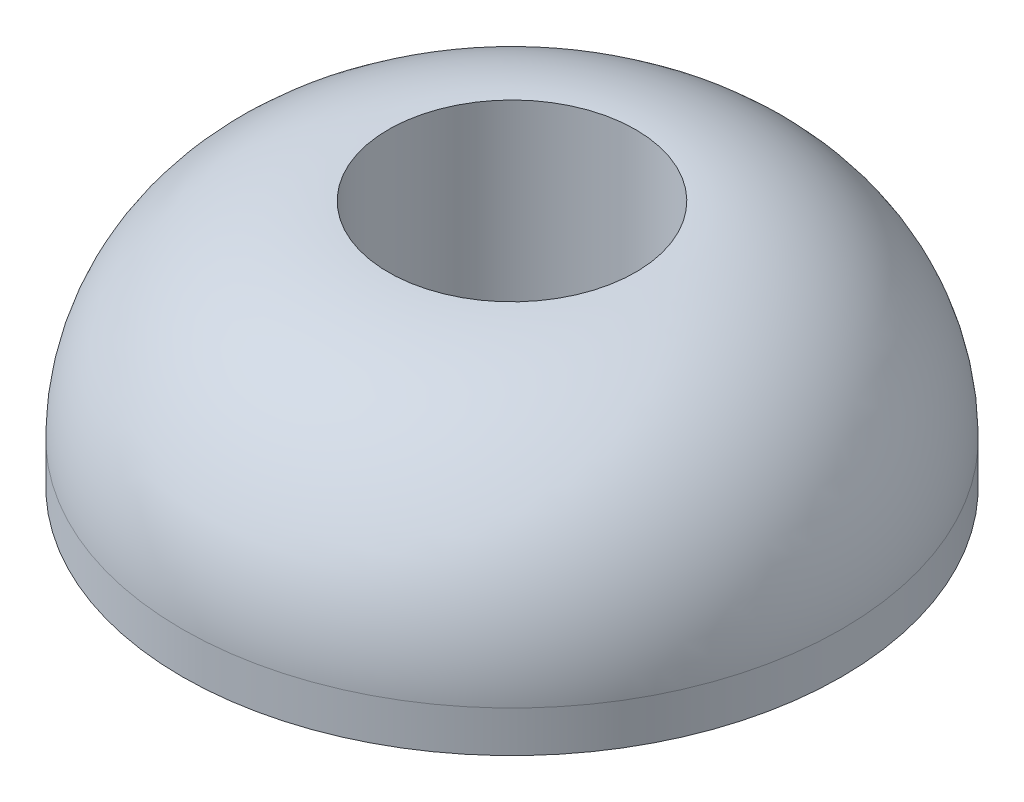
ISO-10303-21;
HEADER;
FILE_DESCRIPTION(('STEP AP214'),'2;1');
FILE_NAME('part.step','',(''),(''),'','','');
FILE_SCHEMA(('AUTOMOTIVE_DESIGN { 1 0 10303 214 1 1 1 1 }'));
ENDSEC;
DATA;
#1=APPLICATION_CONTEXT('core data for automotive mechanical design processes');
#2=APPLICATION_PROTOCOL_DEFINITION('international standard','automotive_design',2000,#1);
#3=PRODUCT_CONTEXT('',#1,'mechanical');
#4=PRODUCT('Part','Part','',(#3));
#5=PRODUCT_RELATED_PRODUCT_CATEGORY('part','',(#4));
#6=PRODUCT_DEFINITION_FORMATION('','',#4);
#7=PRODUCT_DEFINITION_CONTEXT('part definition',#1,'design');
#8=PRODUCT_DEFINITION('design','',#6,#7);
#9=PRODUCT_DEFINITION_SHAPE('','',#8);
#10=(LENGTH_UNIT() NAMED_UNIT(*) SI_UNIT(.MILLI.,.METRE.));
#11=(NAMED_UNIT(*) PLANE_ANGLE_UNIT() SI_UNIT($,.RADIAN.));
#12=(NAMED_UNIT(*) SI_UNIT($,.STERADIAN.) SOLID_ANGLE_UNIT());
#13=UNCERTAINTY_MEASURE_WITH_UNIT(LENGTH_MEASURE(1.E-05),#10,'distance_accuracy_value','');
#14=(GEOMETRIC_REPRESENTATION_CONTEXT(3) GLOBAL_UNCERTAINTY_ASSIGNED_CONTEXT((#13)) GLOBAL_UNIT_ASSIGNED_CONTEXT((#10,
#11,#12)) REPRESENTATION_CONTEXT('',''));
#15=CARTESIAN_POINT('',(0.,0.,0.));
#16=DIRECTION('',(0.,0.,1.));
#17=DIRECTION('',(1.,0.,0.));
#18=AXIS2_PLACEMENT_3D('',#15,#16,#17);
#19=CARTESIAN_POINT('',(0.,-4.45265178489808,0.));
#20=DIRECTION('',(0.,-1.,0.));
#21=DIRECTION('',(0.,0.,-1.));
#22=AXIS2_PLACEMENT_3D('',#19,#20,#21);
#23=CYLINDRICAL_SURFACE('',#22,6.7);
#24=CARTESIAN_POINT('',(0.,0.,0.));
#25=DIRECTION('',(0.,-1.,0.));
#26=DIRECTION('',(0.,0.,-1.));
#27=AXIS2_PLACEMENT_3D('',#24,#25,#26);
#28=CIRCLE('',#27,6.7);
#29=CARTESIAN_POINT('',(0.,0.,-6.7));
#30=VERTEX_POINT('',#29);
#31=EDGE_CURVE('E52',#30,#30,#28,.T.);
#32=ORIENTED_EDGE('',*,*,#31,.T.);
#33=EDGE_LOOP('',(#32));
#34=FACE_BOUND('',#33,.T.);
#35=CARTESIAN_POINT('',(0.,0.999999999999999,0.));
#36=DIRECTION('',(0.,-1.,0.));
#37=DIRECTION('',(0.,0.,-1.));
#38=AXIS2_PLACEMENT_3D('',#35,#36,#37);
#39=CIRCLE('',#38,6.7);
#40=CARTESIAN_POINT('',(0.,0.999999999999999,-6.7));
#41=VERTEX_POINT('',#40);
#42=EDGE_CURVE('E10',#41,#41,#39,.T.);
#43=ORIENTED_EDGE('',*,*,#42,.F.);
#44=EDGE_LOOP('',(#43));
#45=FACE_BOUND('',#44,.T.);
#46=ADVANCED_FACE('F24',(#34,#45),#23,.F.);
#47=CARTESIAN_POINT('',(0.,0.999999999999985,0.));
#48=DIRECTION('',(0.,-1.,0.));
#49=DIRECTION('',(0.,0.,-1.));
#50=AXIS2_PLACEMENT_3D('',#47,#48,#49);
#51=DEGENERATE_TOROIDAL_SURFACE('',#50,2.99999999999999,3.70000000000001,.T.);
#52=ORIENTED_EDGE('',*,*,#42,.T.);
#53=EDGE_LOOP('',(#52));
#54=FACE_BOUND('',#53,.T.);
#55=CARTESIAN_POINT('',(0.,4.46410161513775,0.));
#56=DIRECTION('',(0.,-1.,0.));
#57=DIRECTION('',(0.,0.,-1.));
#58=AXIS2_PLACEMENT_3D('',#55,#56,#57);
#59=CIRCLE('',#58,4.29999999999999);
#60=CARTESIAN_POINT('',(0.,4.46410161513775,-4.29999999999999));
#61=VERTEX_POINT('',#60);
#62=EDGE_CURVE('E30',#61,#61,#59,.T.);
#63=ORIENTED_EDGE('',*,*,#62,.F.);
#64=EDGE_LOOP('',(#63));
#65=FACE_BOUND('',#64,.T.);
#66=ADVANCED_FACE('F90',(#54,#65),#51,.F.);
#67=CARTESIAN_POINT('',(0.,-4.45265178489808,0.));
#68=DIRECTION('',(0.,-1.,0.));
#69=DIRECTION('',(0.,0.,-1.));
#70=AXIS2_PLACEMENT_3D('',#67,#68,#69);
#71=CYLINDRICAL_SURFACE('',#70,4.29999999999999);
#72=ORIENTED_EDGE('',*,*,#62,.T.);
#73=EDGE_LOOP('',(#72));
#74=FACE_BOUND('',#73,.T.);
#75=CARTESIAN_POINT('',(0.,0.999999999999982,0.));
#76=DIRECTION('',(0.,-1.,0.));
#77=DIRECTION('',(0.,0.,-1.));
#78=AXIS2_PLACEMENT_3D('',#75,#76,#77);
#79=CIRCLE('',#78,4.29999999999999);
#80=CARTESIAN_POINT('',(0.,0.999999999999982,-4.29999999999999));
#81=VERTEX_POINT('',#80);
#82=EDGE_CURVE('E34',#81,#81,#79,.T.);
#83=ORIENTED_EDGE('',*,*,#82,.F.);
#84=EDGE_LOOP('',(#83));
#85=FACE_BOUND('',#84,.T.);
#86=ADVANCED_FACE('F85',(#74,#85),#71,.T.);
#87=CARTESIAN_POINT('',(4.29999999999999,0.999999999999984,0.));
#88=DIRECTION('',(0.,1.,0.));
#89=DIRECTION('',(0.,0.,1.));
#90=AXIS2_PLACEMENT_3D('',#87,#88,#89);
#91=PLANE('',#90);
#92=CARTESIAN_POINT('',(0.,0.999999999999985,0.));
#93=DIRECTION('',(0.,-1.,0.));
#94=DIRECTION('',(0.,0.,-1.));
#95=AXIS2_PLACEMENT_3D('',#92,#93,#94);
#96=CIRCLE('',#95,2.99999999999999);
#97=CARTESIAN_POINT('',(0.,0.999999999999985,-2.99999999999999));
#98=VERTEX_POINT('',#97);
#99=EDGE_CURVE('E38',#98,#98,#96,.T.);
#100=ORIENTED_EDGE('',*,*,#99,.F.);
#101=EDGE_LOOP('',(#100));
#102=FACE_BOUND('',#101,.T.);
#103=ORIENTED_EDGE('',*,*,#82,.T.);
#104=EDGE_LOOP('',(#103));
#105=FACE_BOUND('',#104,.T.);
#106=ADVANCED_FACE('F79',(#102,#105),#91,.F.);
#107=CARTESIAN_POINT('',(0.,-4.45265178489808,0.));
#108=DIRECTION('',(0.,-1.,0.));
#109=DIRECTION('',(0.,0.,-1.));
#110=AXIS2_PLACEMENT_3D('',#107,#108,#109);
#111=CYLINDRICAL_SURFACE('',#110,2.99999999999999);
#112=CARTESIAN_POINT('',(0.,6.,0.));
#113=DIRECTION('',(0.,-1.,0.));
#114=DIRECTION('',(0.,0.,-1.));
#115=AXIS2_PLACEMENT_3D('',#112,#113,#114);
#116=CIRCLE('',#115,3.);
#117=CARTESIAN_POINT('',(0.,6.,-3.));
#118=VERTEX_POINT('',#117);
#119=EDGE_CURVE('E43',#118,#118,#116,.T.);
#120=ORIENTED_EDGE('',*,*,#119,.F.);
#121=EDGE_LOOP('',(#120));
#122=FACE_BOUND('',#121,.T.);
#123=ORIENTED_EDGE('',*,*,#99,.T.);
#124=EDGE_LOOP('',(#123));
#125=FACE_BOUND('',#124,.T.);
#126=ADVANCED_FACE('F73',(#122,#125),#111,.F.);
#127=CARTESIAN_POINT('',(0.,0.999999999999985,0.));
#128=DIRECTION('',(0.,-1.,0.));
#129=DIRECTION('',(0.,0.,-1.));
#130=AXIS2_PLACEMENT_3D('',#127,#128,#129);
#131=DEGENERATE_TOROIDAL_SURFACE('',#130,2.99999999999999,5.00000000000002,.T.);
#132=CARTESIAN_POINT('',(0.,0.999999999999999,0.));
#133=DIRECTION('',(0.,-1.,0.));
#134=DIRECTION('',(0.,0.,-1.));
#135=AXIS2_PLACEMENT_3D('',#132,#133,#134);
#136=CIRCLE('',#135,8.);
#137=CARTESIAN_POINT('',(0.,0.999999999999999,-8.));
#138=VERTEX_POINT('',#137);
#139=EDGE_CURVE('E46',#138,#138,#136,.T.);
#140=ORIENTED_EDGE('',*,*,#139,.F.);
#141=EDGE_LOOP('',(#140));
#142=FACE_BOUND('',#141,.T.);
#143=ORIENTED_EDGE('',*,*,#119,.T.);
#144=EDGE_LOOP('',(#143));
#145=FACE_BOUND('',#144,.T.);
#146=ADVANCED_FACE('F67',(#142,#145),#131,.T.);
#147=CARTESIAN_POINT('',(0.,-4.45265178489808,0.));
#148=DIRECTION('',(0.,-1.,0.));
#149=DIRECTION('',(0.,0.,-1.));
#150=AXIS2_PLACEMENT_3D('',#147,#148,#149);
#151=CYLINDRICAL_SURFACE('',#150,8.);
#152=CARTESIAN_POINT('',(0.,0.,0.));
#153=DIRECTION('',(0.,-1.,0.));
#154=DIRECTION('',(0.,0.,-1.));
#155=AXIS2_PLACEMENT_3D('',#152,#153,#154);
#156=CIRCLE('',#155,8.);
#157=CARTESIAN_POINT('',(0.,0.,-8.));
#158=VERTEX_POINT('',#157);
#159=EDGE_CURVE('E49',#158,#158,#156,.T.);
#160=ORIENTED_EDGE('',*,*,#159,.F.);
#161=EDGE_LOOP('',(#160));
#162=FACE_BOUND('',#161,.T.);
#163=ORIENTED_EDGE('',*,*,#139,.T.);
#164=EDGE_LOOP('',(#163));
#165=FACE_BOUND('',#164,.T.);
#166=ADVANCED_FACE('F61',(#162,#165),#151,.T.);
#167=CARTESIAN_POINT('',(8.,0.,0.));
#168=DIRECTION('',(0.,1.,0.));
#169=DIRECTION('',(0.,0.,1.));
#170=AXIS2_PLACEMENT_3D('',#167,#168,#169);
#171=PLANE('',#170);
#172=ORIENTED_EDGE('',*,*,#31,.F.);
#173=EDGE_LOOP('',(#172));
#174=FACE_BOUND('',#173,.T.);
#175=ORIENTED_EDGE('',*,*,#159,.T.);
#176=EDGE_LOOP('',(#175));
#177=FACE_BOUND('',#176,.T.);
#178=ADVANCED_FACE('F58',(#174,#177),#171,.F.);
#179=CLOSED_SHELL('',(#46,#66,#86,#106,#126,#146,#166,#178));
#180=MANIFOLD_SOLID_BREP('B2',#179);
#181=ADVANCED_BREP_SHAPE_REPRESENTATION('',(#18,#180),#14);
#182=SHAPE_DEFINITION_REPRESENTATION(#9,#181);
ENDSEC;
END-ISO-10303-21;
